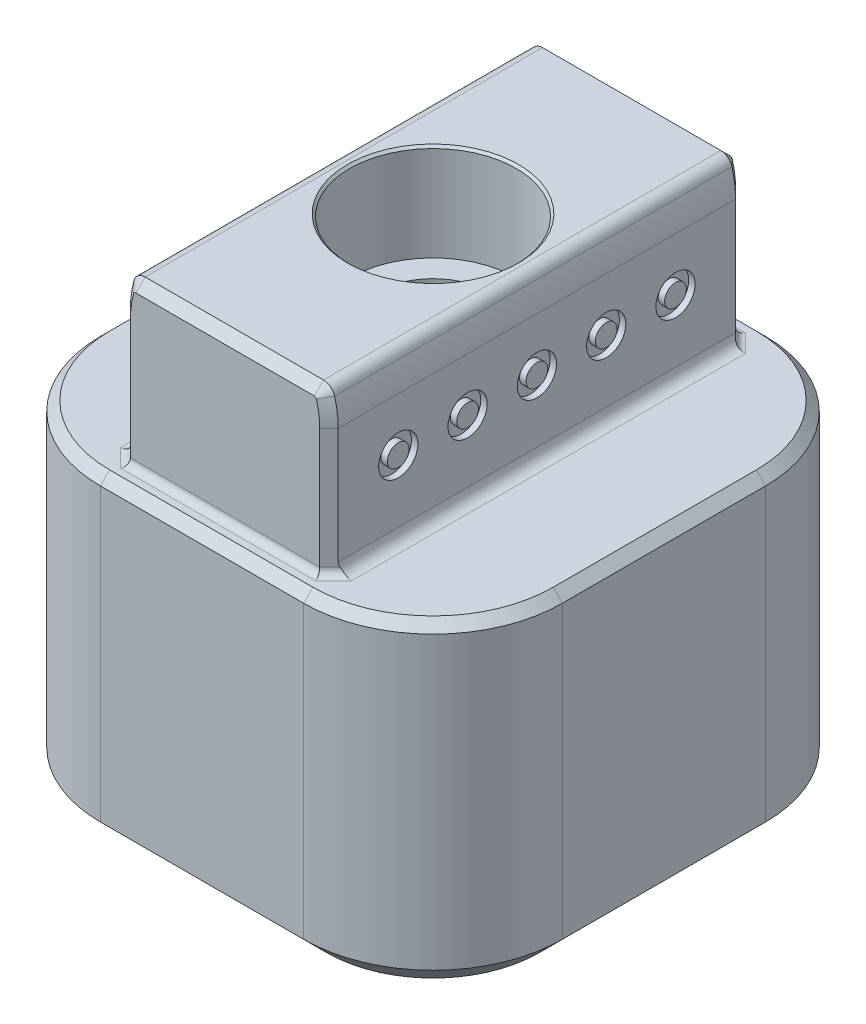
from build123d import *

# Parameters (mm, degrees)
BOSS_EXTRUDE1_START            = -14
BOSS_EXTRUDE1_DEPTH            = 14
SKETCH2_W                      = 8.995
SKETCH2_H                      = 18
BOSS_EXTRUDE2_DEPTH            = 7
CUT_EXTRUDE3_DEPTH             = 26.632011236
CBORE_FOR_M4_SHCS1_D           = 5
CBORE_FOR_M4_SHCS1_CBORE_D     = 7.2
CBORE_FOR_M4_SHCS1_CBORE_DEPTH = 4.2
M6X1_0_TAPPED_HOLE1_D          = 5.001
SKETCH8_R                      = 0.85
SKETCH8_R_2                    = 0.47
CUT_EXTRUDE4_DEPTH             = 0.28
CHAMFER1_SIZE                  = 0.4
FILLET1_R                      = 0.5
FILLET2_R                      = 0.3
CHAMFER2_SIZE                  = 1
CHAMFER3_SIZE                  = 0.5
CHAMFER4_SIZE                  = 0.1


with BuildPart() as part:
    # Sketch1 → Boss-Extrude1 (new body)
    with BuildSketch(Plane(origin=(0, 0, 0), x_dir=(1, 0, 0), z_dir=(0, 1, 0)).offset(BOSS_EXTRUDE1_START)):
        with BuildLine():
            Line((-4.4, 10), (4.4, 10))
            ThreePointArc((4.4, 10), (8.359797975, 8.359797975), (10, 4.4))
            Line((10, 4.4), (10, -4.4))
            ThreePointArc((10, -4.4), (8.359797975, -8.359797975), (4.4, -10))
            Line((4.4, -10), (-4.4, -10))
            ThreePointArc((-4.4, -10), (-8.359797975, -8.359797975), (-10, -4.4))
            Line((-10, -4.4), (-10, 4.4))
            ThreePointArc((-10, 4.4), (-8.359797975, 8.359797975), (-4.4, 10))
        make_face()
    extrude(amount=BOSS_EXTRUDE1_DEPTH)

    # Sketch2 → Boss-Extrude2 (add)
    with BuildSketch(Plane(origin=(0, 0, 0), x_dir=(1, 0, 0), z_dir=(0, 1, 0))):
        Rectangle(SKETCH2_W, SKETCH2_H)
    extrude(amount=BOSS_EXTRUDE2_DEPTH)

    # Sketch3 → Cut-Extrude3 (cut, through all)
    with BuildSketch(Plane.XY.offset(9)):
        with BuildLine():
            Line((3.859802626, 7), (4.4975, 7))
            Line((4.4975, 7), (4.4975, 5.5))
            ThreePointArc((4.4975, 5.5), (4.458240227, 6.072923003), (4.341194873, 6.635135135))
            ThreePointArc((4.341194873, 6.635135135), (4.161822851, 6.89847683), (3.859802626, 7))
        make_face()
        with BuildLine():
            Line((-4.4975, 7), (-4.4975, 5.5))
            ThreePointArc((-4.4975, 5.5), (-4.458240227, 6.072923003), (-4.341194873, 6.635135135))
            ThreePointArc((-4.341194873, 6.635135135), (-4.161822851, 6.89847683), (-3.859802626, 7))
            Line((-3.859802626, 7), (-4.4975, 7))
        make_face()
    extrude(amount=-CUT_EXTRUDE3_DEPTH, mode=Mode.SUBTRACT)

    # CBORE for M4 SHCS1 (through all)
    with Locations(Plane(origin=(0, 7, 0), x_dir=(1, 0, 0), z_dir=(0, 1, 0))):
        with Locations((0, 0)):
            CounterBoreHole(CBORE_FOR_M4_SHCS1_D / 2, CBORE_FOR_M4_SHCS1_CBORE_D / 2, CBORE_FOR_M4_SHCS1_CBORE_DEPTH)

    # M6x1.0 Tapped Hole1 (through all)
    with Locations(Plane(origin=(0, 2.8, 0), x_dir=(1, 0, 0), z_dir=(0, 1, 0))):
        with Locations((0, 0)):
            Hole(M6X1_0_TAPPED_HOLE1_D / 2)

    # Sketch8 → Cut-Extrude4 (cut)
    # profile 1 of 5: a face of its own
    with BuildSketch(Plane(origin=(4.4975, 0, 0), x_dir=(0, 0, -1), z_dir=(1, 0, 0))):
        with Locations((-6, 3.2)):
            Circle(SKETCH8_R)
        with Locations((-6, 3.2)):
            Circle(SKETCH8_R_2, mode=Mode.SUBTRACT)
    # profile 2 of 5: a face of its own
    with BuildSketch(Plane(origin=(4.4975, 0, 0), x_dir=(0, 0, -1), z_dir=(1, 0, 0))):
        with Locations((-3, 3.2)):
            Circle(SKETCH8_R)
        with Locations((-3, 3.2)):
            Circle(SKETCH8_R_2, mode=Mode.SUBTRACT)
    # profile 3 of 5: a face of its own
    with BuildSketch(Plane(origin=(4.4975, 0, 0), x_dir=(0, 0, -1), z_dir=(1, 0, 0))):
        with Locations((0, 3.2)):
            Circle(SKETCH8_R)
        with Locations((0, 3.2)):
            Circle(SKETCH8_R_2, mode=Mode.SUBTRACT)
    # profile 4 of 5: a face of its own
    with BuildSketch(Plane(origin=(4.4975, 0, 0), x_dir=(0, 0, -1), z_dir=(1, 0, 0))):
        with Locations((3, 3.2)):
            Circle(SKETCH8_R)
        with Locations((3, 3.2)):
            Circle(SKETCH8_R_2, mode=Mode.SUBTRACT)
    # profile 5 of 5: a face of its own
    with BuildSketch(Plane(origin=(4.4975, 0, 0), x_dir=(0, 0, -1), z_dir=(1, 0, 0))):
        with Locations((6, 3.2)):
            Circle(SKETCH8_R)
        with Locations((6, 3.2)):
            Circle(SKETCH8_R_2, mode=Mode.SUBTRACT)
    cut_extrude4 = extrude(amount=-CUT_EXTRUDE4_DEPTH, mode=Mode.SUBTRACT)

    # Mirror1: Cut-Extrude4 across plane
    add(cut_extrude4.mirror(Plane(origin=(0, 0, 0), x_dir=(0, 0, 1), z_dir=(1, 0, 0))), mode=Mode.SUBTRACT)

    # Chamfer1
    chamfer1_edges = [part.edges().sort_by_distance(p)[0] for p in [
        (-8.359797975, 0, -8.359797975),
        (-10, 0, 0),
        (-8.359797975, 0, 8.359797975),
        (0, 0, 10),
        (8.359797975, 0, 8.359797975),
        (10, 0, 0),
        (0, 7, 9),
        (0, 7, -9),
        (-4.4975, 2.75, -9),
        (4.4975, 2.75, -9),
        (-4.458240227, 6.072923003, -9),
        (4.458240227, 6.072923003, -9),
        (4.4975, 2.75, 9),
        (-4.4975, 2.75, 9),
        (4.161822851, 6.89847683, -9),
        (4.458240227, 6.072923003, 9),
        (4.161822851, 6.89847683, 9),
        (8.359797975, 0, -8.359797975),
        (-4.161822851, 6.89847683, -9),
        (-4.458240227, 6.072923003, 9),
        (-4.161822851, 6.89847683, 9),
        (0, 0, -10),
    ]]
    chamfer(chamfer1_edges, length=CHAMFER1_SIZE)

    # Fillet1
    fillet1_edges = [part.edges().sort_by_distance(p)[0] for p in [
        (4.4975, 0, 0),
        (-4.4975, 0, 0),
    ]]
    fillet(fillet1_edges, radius=FILLET1_R)

    # Fillet2
    fillet2_edges = [part.edges().sort_by_distance(p)[0] for p in [
        (0, 0, -9),
        (0, 0, 9),
        (-4.5475, 0, -8.55),
        (4.5475, 0, -8.55),
        (4.5475, 0, 8.55),
        (-4.5475, 0, 8.55),
    ]]
    fillet(fillet2_edges, radius=FILLET2_R)

    # Chamfer2
    chamfer2_edges = [part.edges().sort_by_distance(p)[0] for p in [
        (-10, -14, 0),
        (-8.359797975, -14, -8.359797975),
        (0, -14, -10),
        (8.359797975, -14, -8.359797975),
        (10, -14, 0),
        (8.359797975, -14, 8.359797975),
        (0, -14, 10),
        (-8.359797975, -14, 8.359797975),
    ]]
    chamfer(chamfer2_edges, length=CHAMFER2_SIZE)

    # Chamfer3
    chamfer3_edges = [part.edges().sort_by_distance(p)[0] for p in [
        (2.5005, -14, 0),
    ]]
    chamfer(chamfer3_edges, length=CHAMFER3_SIZE)

    # Chamfer4
    chamfer4_edges = [part.edges().sort_by_distance(p)[0] for p in [
        (-3.6, 7, 0),
    ]]
    chamfer(chamfer4_edges, length=CHAMFER4_SIZE)


solid = part.part
